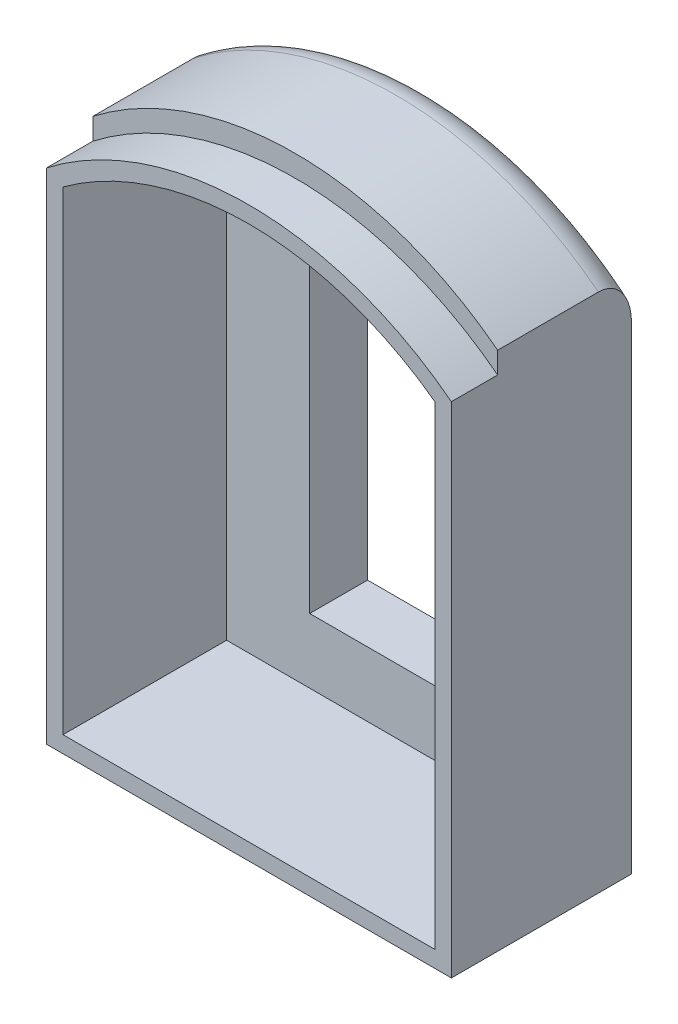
from build123d import *

# Parameters (mm, degrees)
BOSS_EXTRUDE1_DEPTH = 10
SHELL1_T            = -1
BOSS_EXTRUDE6_DEPTH = 7.2
BOSS_EXTRUDE7_START = 0.9
BOSS_EXTRUDE7_DEPTH = 0.9
CUT_EXTRUDE1_START  = -0.9
CUT_EXTRUDE1_DEPTH  = 0.9
FILLET1_R           = 2
SKETCH12_W          = 16.446
SKETCH12_H          = 23.05
BOSS_EXTRUDE9_DEPTH = 2.5
SKETCH14_W          = 12.446
SKETCH14_H          = 19.05
CUT_EXTRUDE5_DEPTH  = 3.5
FILLET2_R           = 1


with BuildPart() as part:
    # Sketch1 → Boss-Extrude1 (new body)
    with BuildSketch(Plane.XY):
        with BuildLine():
            Line((-12.25, 30.2), (-12.25, 0))
            Line((-12.25, 0), (12.25, 0))
            Line((12.25, 0), (12.25, 30.2))
            ThreePointArc((12.25, 30.2), (0, 34.390588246), (-12.25, 30.2))
        make_face()
    extrude(amount=BOSS_EXTRUDE1_DEPTH)

    # Shell1
    shell1_openings = [part.faces().sort_by_distance(p)[0] for p in [
        (0, 16.551787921, 10),
    ]]
    offset(amount=SHELL1_T, openings=shell1_openings, kind=Kind.INTERSECTION)

    # Sketch6 → Boss-Extrude6 (add)
    with BuildSketch(Plane(origin=(0, 0, 0), x_dir=(-1, 0, 0), z_dir=(0, 0, -1))):
        with BuildLine():
            Line((-12.25, 30.2), (-12.25, 31.5))
            ThreePointArc((-12.25, 31.5), (0, 35.690588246), (12.25, 31.5))
            Line((12.25, 31.5), (12.25, 30.2))
            ThreePointArc((12.25, 30.2), (0, 34.390588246), (-12.25, 30.2))
        make_face()
    extrude(amount=-BOSS_EXTRUDE6_DEPTH)

    # Sketch7 → Boss-Extrude7 (add)
    with BuildSketch(Plane(origin=(0, 0, 0), x_dir=(-1, 0, 0), z_dir=(0, 0, -1)).offset(BOSS_EXTRUDE7_START)):
        with BuildLine():
            Line((12.25, 0), (12.25, 31.5))
            ThreePointArc((12.25, 31.5), (0, 35.690588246), (-12.25, 31.5))
            Line((-12.25, 31.5), (-12.25, 0))
            Line((-12.25, 0), (12.25, 0))
        make_face()
    extrude(amount=-BOSS_EXTRUDE7_DEPTH)

    # Sketch8 → Cut-Extrude1 (cut)
    with BuildSketch(Plane.XY.offset(1).offset(CUT_EXTRUDE1_START)):
        with BuildLine():
            Line((-11.25, 29.701940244), (-11.25, 1))
            Line((-11.25, 1), (11.25, 1))
            Line((11.25, 1), (11.25, 29.701940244))
            ThreePointArc((11.25, 29.701940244), (0, 33.390588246), (-11.25, 29.701940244))
        make_face()
    extrude(amount=CUT_EXTRUDE1_DEPTH, mode=Mode.SUBTRACT)

    # Fillet1
    fillet1_edges = [part.edges().sort_by_distance(p)[0] for p in [
        (0, 35.690588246, -0.9),
    ]]
    fillet(fillet1_edges, radius=FILLET1_R)

    # Sketch12 → Boss-Extrude9 (add)
    with BuildSketch(Plane(origin=(0, 0, -0.9), x_dir=(-1, 0, 0), z_dir=(0, 0, -1))):
        with Locations((0, 14.439562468)):
            Rectangle(SKETCH12_W, SKETCH12_H)
    extrude(amount=BOSS_EXTRUDE9_DEPTH)

    # Sketch14 → Cut-Extrude5 (cut)
    with BuildSketch(Plane(origin=(0, 0, -3.4), x_dir=(-1, 0, 0), z_dir=(0, 0, -1))):
        with Locations((0, 14.439562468)):
            Rectangle(SKETCH14_W, SKETCH14_H)
    extrude(amount=-CUT_EXTRUDE5_DEPTH, mode=Mode.SUBTRACT)

    # Fillet2
    fillet2_edges = [part.edges().sort_by_distance(p)[0] for p in [
        (8.223, 14.439562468, -0.9),
        (0, 2.914562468, -0.9),
        (-8.223, 14.439562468, -0.9),
        (0, 25.964562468, -0.9),
        (8.223, 14.439562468, -3.4),
        (0, 2.914562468, -3.4),
        (-8.223, 14.439562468, -3.4),
        (0, 25.964562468, -3.4),
    ]]
    fillet(fillet2_edges, radius=FILLET2_R)


solid = part.part
